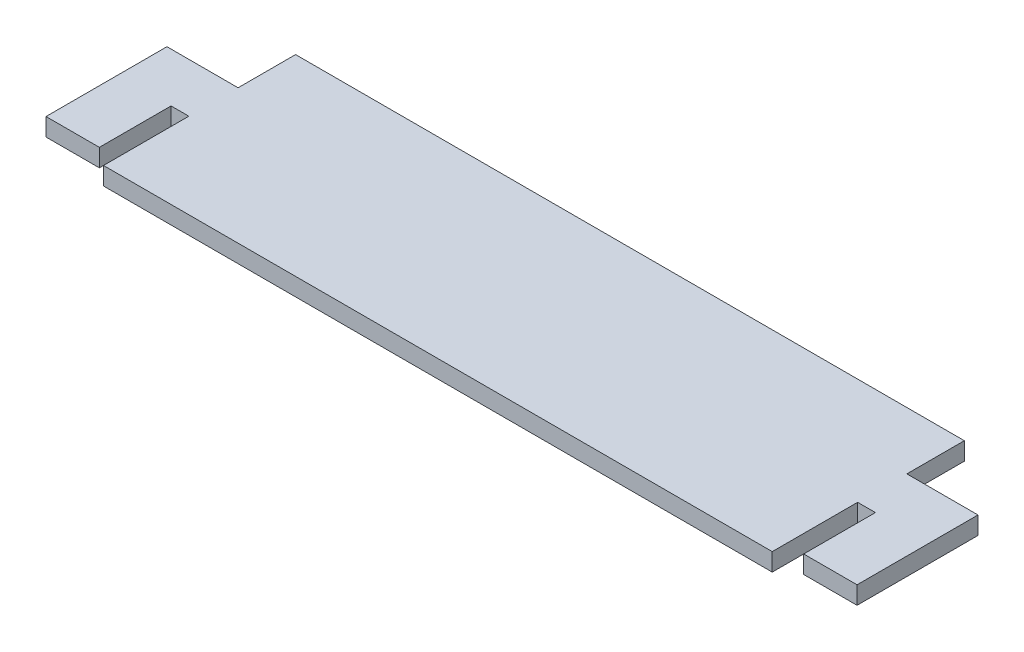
from build123d import *

# Parameters (mm, degrees)
BOSS_EXTRUDE1_DEPTH = 12.5


with BuildPart() as part:
    # Sketch1 → Boss-Extrude1 (new body)
    with BuildSketch(Plane(origin=(0, 0, 0), x_dir=(1, 0, 0), z_dir=(0, 1, 0))):
        Polygon((-235, 67.5), (235, 67.5), (235, 27.099393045), (285, 27.099393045), (285, -57.900606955), (247.5, -57.900606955), (247.5, -7.5), (235, -7.5), (235, -67.5), (-235, -67.5), (-235, -7.5), (-247.5, -7.5), (-247.5, -57.900606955), (-285, -57.900606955), (-285, 27.099393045), (-235, 27.099393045), align=None)
    extrude(amount=BOSS_EXTRUDE1_DEPTH)


solid = part.part
